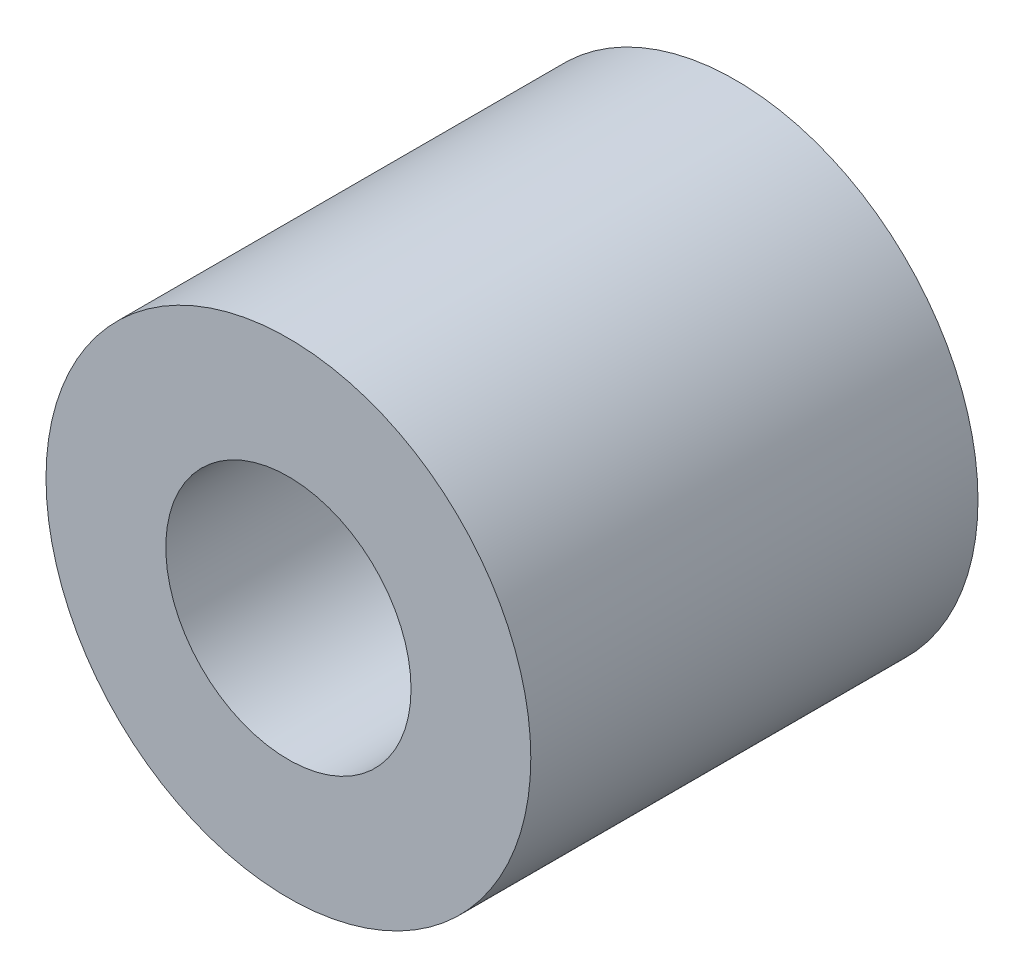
from build123d import *

# Parameters (mm, degrees)
ESQUISSE1_R        = 31.982873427
ESQUISSE1_R_2      = 16.178674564
BOSS_EXTRU_1_DEPTH = 59


with BuildPart() as part:
    # Esquisse1 → Boss.-Extru.1 (new body)
    with BuildSketch(Plane.XY):
        Circle(ESQUISSE1_R)
        Circle(ESQUISSE1_R_2, mode=Mode.SUBTRACT)
    extrude(amount=BOSS_EXTRU_1_DEPTH)


solid = part.part
